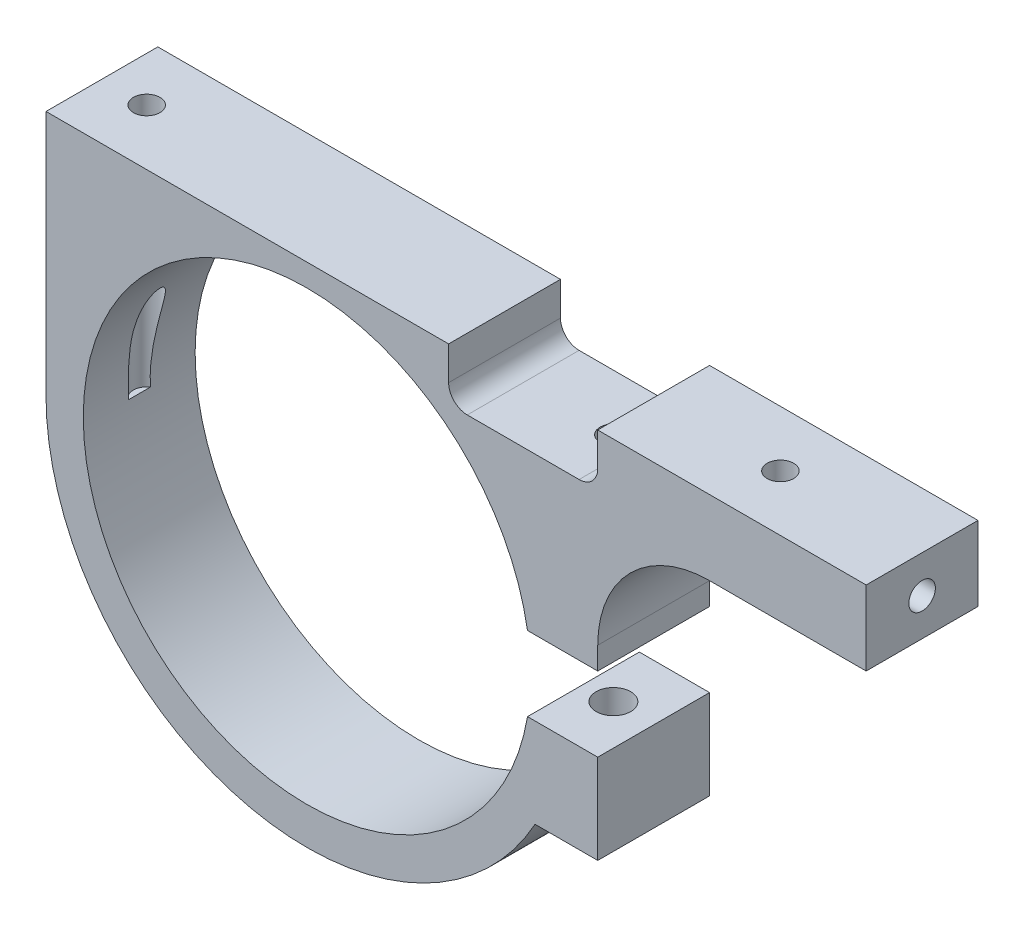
from build123d import *

# Parameters (mm, degrees)
BOSS_EXTRUDE1_DEPTH = 4.7625
SKETCH2_R           = 1.1303
CUT_EXTRUDE1_DEPTH  = 21.59
SKETCH3_R           = 1.1303
CUT_EXTRUDE2_DEPTH  = 65.461883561
CUT_EXTRUDE3_REACH  = 59.436
SKETCH4_R           = 1.4732
SKETCH5_R           = 1.1303
CUT_EXTRUDE4_DEPTH  = 12.7
SKETCH6_R           = 3.175
CUT_EXTRUDE5_DEPTH  = 58.435916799


with BuildPart() as part:
    # Sketch1 → Boss-Extrude1 (new, symmetric)
    with BuildSketch(Plane.XY):
        with BuildLine():
            Line((34.29, 14.605), (47.625, 14.605))
            Line((47.625, 14.605), (47.625, 20.955))
            Line((47.625, 20.955), (24.765, 20.955))
            Line((24.765, 20.955), (24.765, 18.0975))
            ThreePointArc((24.765, 18.0975), (24.300032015, 16.974967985), (23.1775, 16.51))
            Line((23.1775, 16.51), (13.6525, 16.51))
            ThreePointArc((13.6525, 16.51), (12.529967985, 16.974967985), (12.065, 18.0975))
            Line((12.065, 18.0975), (12.065, 20.955))
            Line((12.065, 20.955), (-22.225, 20.955))
            Line((-22.225, 20.955), (-22.225, 0))
            ThreePointArc((-22.225, 0), (-5.575826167, -21.514199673), (19.427264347, -10.795))
            Line((19.427264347, -10.795), (24.765, -10.795))
            Line((24.765, -10.795), (24.765, -3.175))
            Line((24.765, -3.175), (18.783553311, -3.175))
            ThreePointArc((18.783553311, -3.175), (-19.05, 0), (18.783553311, 3.175))
            Line((18.783553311, 3.175), (24.765, 3.175))
            Line((24.765, 3.175), (24.765, 5.08))
            ThreePointArc((24.765, 5.08), (27.554807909, 11.815192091), (34.29, 14.605))
        make_face()
    extrude(amount=BOSS_EXTRUDE1_DEPTH, both=True)

    # Sketch2 → Cut-Extrude1 (cut)
    with BuildSketch(Plane(origin=(0, 20.955, 0), x_dir=(1, 0, 0), z_dir=(0, 1, 0))):
        with Locations(Location((-18.415, 0, 0), (0, 0, 270))):
            Circle(SKETCH2_R)
        with Locations(Location((35.56, 0, 0), (0, 0, 270))):
            Circle(SKETCH2_R)
        with Locations((21.336, 0)):
            Circle(SKETCH2_R)
    extrude(amount=-CUT_EXTRUDE1_DEPTH, mode=Mode.SUBTRACT)

    # Sketch3 → Cut-Extrude2 (cut, through all)
    with BuildSketch(Plane(origin=(0, 20.955, 0), x_dir=(1, 0, 0), z_dir=(0, 1, 0))):
        with Locations((21.336, 0)):
            Circle(SKETCH3_R)
    extrude(amount=-CUT_EXTRUDE2_DEPTH, mode=Mode.SUBTRACT)

    # Sketch4 → Cut-Extrude3 (cut, up to next)
    with BuildSketch(Plane.XZ.offset(10.795), mode=Mode.PRIVATE) as cut_extrude3_sk1:
        with Locations((21.336, 0)):
            Circle(SKETCH4_R)
    cut_extrude3_tool1 = extrude(cut_extrude3_sk1.sketch, amount=-CUT_EXTRUDE3_REACH, mode=Mode.PRIVATE) & part.part
    add(cut_extrude3_tool1.solids().sort_by_distance((21.336, -10.795, 0))[0], mode=Mode.SUBTRACT)

    # Sketch5 → Cut-Extrude4 (cut)
    with BuildSketch(Plane(origin=(47.625, 0, 0), x_dir=(0, 0, -1), z_dir=(1, 0, 0))):
        with Locations((0, 17.78)):
            Circle(SKETCH5_R)
    extrude(amount=-CUT_EXTRUDE4_DEPTH, mode=Mode.SUBTRACT)

    # Sketch6 → Cut-Extrude5 (cut, through all)
    with BuildSketch(Plane.XZ.offset(10.795)):
        with Locations((21.336, 0)):
            Circle(SKETCH6_R)
    extrude(amount=CUT_EXTRUDE5_DEPTH, mode=Mode.SUBTRACT)


solid = part.part
